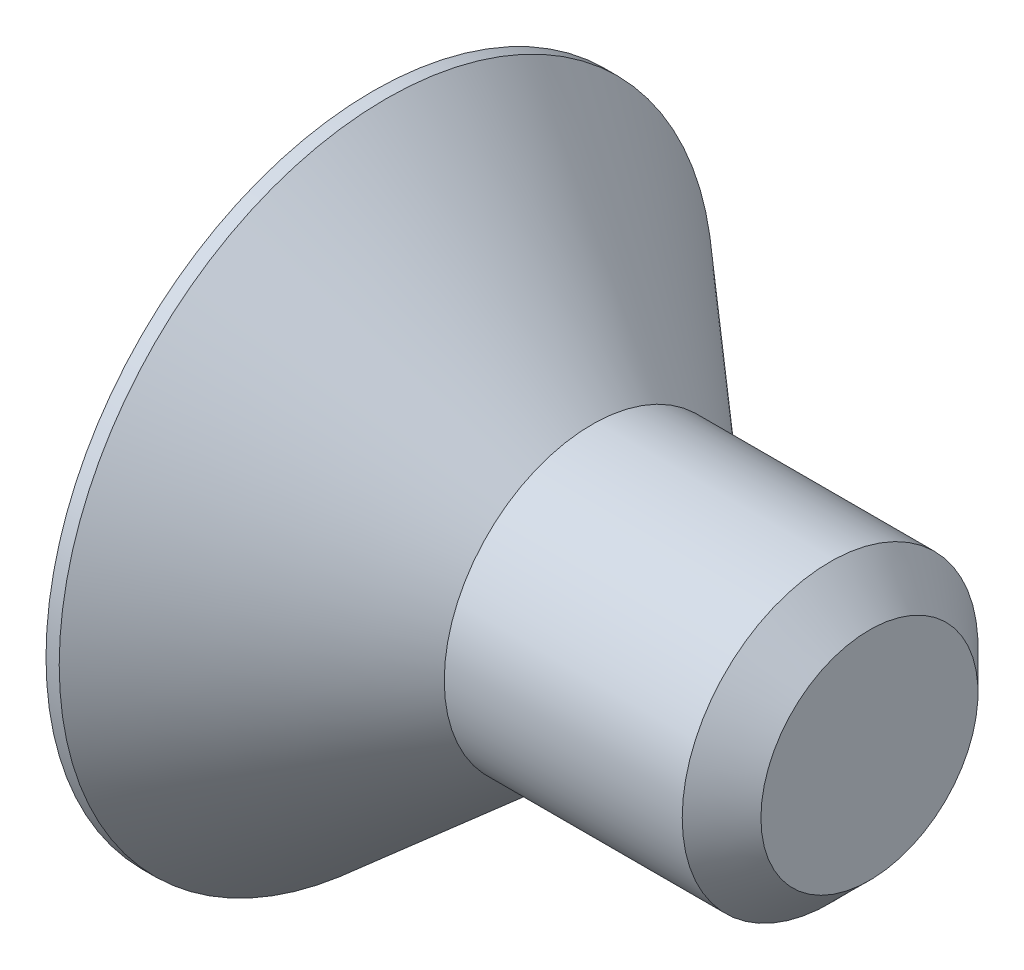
ISO-10303-21;
HEADER;
FILE_DESCRIPTION(('STEP AP214'),'2;1');
FILE_NAME('part.step','',(''),(''),'','','');
FILE_SCHEMA(('AUTOMOTIVE_DESIGN { 1 0 10303 214 1 1 1 1 }'));
ENDSEC;
DATA;
#1=APPLICATION_CONTEXT('core data for automotive mechanical design processes');
#2=APPLICATION_PROTOCOL_DEFINITION('international standard','automotive_design',2000,#1);
#3=PRODUCT_CONTEXT('',#1,'mechanical');
#4=PRODUCT('Part','Part','',(#3));
#5=PRODUCT_RELATED_PRODUCT_CATEGORY('part','',(#4));
#6=PRODUCT_DEFINITION_FORMATION('','',#4);
#7=PRODUCT_DEFINITION_CONTEXT('part definition',#1,'design');
#8=PRODUCT_DEFINITION('design','',#6,#7);
#9=PRODUCT_DEFINITION_SHAPE('','',#8);
#10=(LENGTH_UNIT() NAMED_UNIT(*) SI_UNIT(.MILLI.,.METRE.));
#11=(NAMED_UNIT(*) PLANE_ANGLE_UNIT() SI_UNIT($,.RADIAN.));
#12=(NAMED_UNIT(*) SI_UNIT($,.STERADIAN.) SOLID_ANGLE_UNIT());
#13=UNCERTAINTY_MEASURE_WITH_UNIT(LENGTH_MEASURE(1.E-05),#10,'distance_accuracy_value','');
#14=(GEOMETRIC_REPRESENTATION_CONTEXT(3) GLOBAL_UNCERTAINTY_ASSIGNED_CONTEXT((#13)) GLOBAL_UNIT_ASSIGNED_CONTEXT((#10,
#11,#12)) REPRESENTATION_CONTEXT('',''));
#15=CARTESIAN_POINT('',(0.,0.,0.));
#16=DIRECTION('',(0.,0.,1.));
#17=DIRECTION('',(1.,0.,0.));
#18=AXIS2_PLACEMENT_3D('',#15,#16,#17);
#19=CARTESIAN_POINT('',(0.,0.,0.));
#20=DIRECTION('',(-1.,0.,0.));
#21=DIRECTION('',(0.,0.,1.));
#22=AXIS2_PLACEMENT_3D('',#19,#20,#21);
#23=PLANE('',#22);
#24=CARTESIAN_POINT('',(0.,0.,0.));
#25=DIRECTION('',(-1.,0.,0.));
#26=DIRECTION('',(0.,0.,1.));
#27=AXIS2_PLACEMENT_3D('',#24,#25,#26);
#28=CIRCLE('',#27,3.14452);
#29=CARTESIAN_POINT('',(0.,0.,3.14452));
#30=VERTEX_POINT('',#29);
#31=EDGE_CURVE('E11',#30,#30,#28,.T.);
#32=ORIENTED_EDGE('',*,*,#31,.T.);
#33=EDGE_LOOP('',(#32));
#34=FACE_BOUND('',#33,.T.);
#35=DIRECTION('',(0.,-0.5,-0.866025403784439));
#36=VECTOR('',#35,1.);
#37=CARTESIAN_POINT('',(0.,-0.458271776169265,0.79375));
#38=LINE('',#37,#36);
#39=CARTESIAN_POINT('',(0.,-0.458271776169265,0.79375));
#40=VERTEX_POINT('',#39);
#41=CARTESIAN_POINT('',(0.,-0.916543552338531,0.));
#42=VERTEX_POINT('',#41);
#43=EDGE_CURVE('E116',#40,#42,#38,.T.);
#44=ORIENTED_EDGE('',*,*,#43,.T.);
#45=DIRECTION('',(0.,0.5,-0.866025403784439));
#46=VECTOR('',#45,1.);
#47=CARTESIAN_POINT('',(0.,-0.91654355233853,0.));
#48=LINE('',#47,#46);
#49=CARTESIAN_POINT('',(0.,-0.458271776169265,-0.79375));
#50=VERTEX_POINT('',#49);
#51=EDGE_CURVE('E47',#42,#50,#48,.T.);
#52=ORIENTED_EDGE('',*,*,#51,.T.);
#53=DIRECTION('',(0.,1.,0.));
#54=VECTOR('',#53,1.);
#55=CARTESIAN_POINT('',(0.,-0.458271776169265,-0.79375));
#56=LINE('',#55,#54);
#57=CARTESIAN_POINT('',(0.,0.458271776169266,-0.79375));
#58=VERTEX_POINT('',#57);
#59=EDGE_CURVE('E127',#50,#58,#56,.T.);
#60=ORIENTED_EDGE('',*,*,#59,.T.);
#61=DIRECTION('',(0.,0.5,0.866025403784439));
#62=VECTOR('',#61,1.);
#63=CARTESIAN_POINT('',(0.,0.458271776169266,-0.79375));
#64=LINE('',#63,#62);
#65=CARTESIAN_POINT('',(0.,0.916543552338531,0.));
#66=VERTEX_POINT('',#65);
#67=EDGE_CURVE('E198',#58,#66,#64,.T.);
#68=ORIENTED_EDGE('',*,*,#67,.T.);
#69=DIRECTION('',(0.,-0.5,0.866025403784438));
#70=VECTOR('',#69,1.);
#71=CARTESIAN_POINT('',(0.,0.916543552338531,0.));
#72=LINE('',#71,#70);
#73=CARTESIAN_POINT('',(0.,0.458271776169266,0.79375));
#74=VERTEX_POINT('',#73);
#75=EDGE_CURVE('E181',#66,#74,#72,.T.);
#76=ORIENTED_EDGE('',*,*,#75,.T.);
#77=DIRECTION('',(0.,-1.,0.));
#78=VECTOR('',#77,1.);
#79=CARTESIAN_POINT('',(0.,0.458271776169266,0.79375));
#80=LINE('',#79,#78);
#81=EDGE_CURVE('E176',#74,#40,#80,.T.);
#82=ORIENTED_EDGE('',*,*,#81,.T.);
#83=EDGE_LOOP('',(#44,#52,#60,#68,#76,#82));
#84=FACE_BOUND('',#83,.T.);
#85=ADVANCED_FACE('F33',(#34,#84),#23,.T.);
#86=CARTESIAN_POINT('',(0.,0.,0.));
#87=DIRECTION('',(-1.,0.,0.));
#88=DIRECTION('',(0.,0.,1.));
#89=AXIS2_PLACEMENT_3D('',#86,#87,#88);
#90=CYLINDRICAL_SURFACE('',#89,3.14452);
#91=CARTESIAN_POINT('',(0.127,0.,0.));
#92=DIRECTION('',(-1.,0.,0.));
#93=DIRECTION('',(0.,0.,1.));
#94=AXIS2_PLACEMENT_3D('',#91,#92,#93);
#95=CIRCLE('',#94,3.14452);
#96=CARTESIAN_POINT('',(0.127,0.,3.14452));
#97=VERTEX_POINT('',#96);
#98=EDGE_CURVE('E40',#97,#97,#95,.T.);
#99=ORIENTED_EDGE('',*,*,#98,.T.);
#100=EDGE_LOOP('',(#99));
#101=FACE_BOUND('',#100,.T.);
#102=ORIENTED_EDGE('',*,*,#31,.F.);
#103=EDGE_LOOP('',(#102));
#104=FACE_BOUND('',#103,.T.);
#105=ADVANCED_FACE('F152',(#101,#104),#90,.T.);
#106=CARTESIAN_POINT('',(0.127,0.,0.));
#107=DIRECTION('',(-1.,0.,0.));
#108=DIRECTION('',(0.,0.,1.));
#109=AXIS2_PLACEMENT_3D('',#106,#107,#108);
#110=CONICAL_SURFACE('',#109,3.14452,0.715584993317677);
#111=CARTESIAN_POINT('',(2.10807244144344,0.,0.));
#112=DIRECTION('',(-1.,0.,0.));
#113=DIRECTION('',(0.,0.,1.));
#114=AXIS2_PLACEMENT_3D('',#111,#112,#113);
#115=CIRCLE('',#114,1.4224);
#116=CARTESIAN_POINT('',(2.10807244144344,0.,1.4224));
#117=VERTEX_POINT('',#116);
#118=EDGE_CURVE('E147',#117,#117,#115,.T.);
#119=ORIENTED_EDGE('',*,*,#118,.T.);
#120=EDGE_LOOP('',(#119));
#121=FACE_BOUND('',#120,.T.);
#122=ORIENTED_EDGE('',*,*,#98,.F.);
#123=EDGE_LOOP('',(#122));
#124=FACE_BOUND('',#123,.T.);
#125=ADVANCED_FACE('F155',(#121,#124),#110,.T.);
#126=CARTESIAN_POINT('',(0.,0.,0.));
#127=DIRECTION('',(-1.,0.,0.));
#128=DIRECTION('',(0.,0.,1.));
#129=AXIS2_PLACEMENT_3D('',#126,#127,#128);
#130=CYLINDRICAL_SURFACE('',#129,1.42239999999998);
#131=CARTESIAN_POINT('',(4.39673999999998,0.,0.));
#132=DIRECTION('',(-1.,0.,0.));
#133=DIRECTION('',(0.,0.,1.));
#134=AXIS2_PLACEMENT_3D('',#131,#132,#133);
#135=CIRCLE('',#134,1.42239999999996);
#136=CARTESIAN_POINT('',(4.39673999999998,0.,1.42239999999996));
#137=VERTEX_POINT('',#136);
#138=EDGE_CURVE('E144',#137,#137,#135,.T.);
#139=ORIENTED_EDGE('',*,*,#138,.T.);
#140=EDGE_LOOP('',(#139));
#141=FACE_BOUND('',#140,.T.);
#142=ORIENTED_EDGE('',*,*,#118,.F.);
#143=EDGE_LOOP('',(#142));
#144=FACE_BOUND('',#143,.T.);
#145=ADVANCED_FACE('F157',(#141,#144),#130,.T.);
#146=CARTESIAN_POINT('',(4.7752,0.,0.));
#147=DIRECTION('',(-1.,0.,0.));
#148=DIRECTION('',(0.,0.,1.));
#149=AXIS2_PLACEMENT_3D('',#146,#147,#148);
#150=CONICAL_SURFACE('',#149,1.04394,0.785398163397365);
#151=ORIENTED_EDGE('',*,*,#138,.F.);
#152=EDGE_LOOP('',(#151));
#153=FACE_BOUND('',#152,.T.);
#154=CARTESIAN_POINT('',(4.7752,0.,0.));
#155=DIRECTION('',(-1.,0.,0.));
#156=DIRECTION('',(0.,0.,1.));
#157=AXIS2_PLACEMENT_3D('',#154,#155,#156);
#158=CIRCLE('',#157,1.04394);
#159=CARTESIAN_POINT('',(4.7752,0.,1.04394));
#160=VERTEX_POINT('',#159);
#161=EDGE_CURVE('E140',#160,#160,#158,.T.);
#162=ORIENTED_EDGE('',*,*,#161,.T.);
#163=EDGE_LOOP('',(#162));
#164=FACE_BOUND('',#163,.T.);
#165=ADVANCED_FACE('F164',(#153,#164),#150,.T.);
#166=CARTESIAN_POINT('',(4.7752,1.04394,0.));
#167=DIRECTION('',(1.,0.,0.));
#168=DIRECTION('',(0.,0.,-1.));
#169=AXIS2_PLACEMENT_3D('',#166,#167,#168);
#170=PLANE('',#169);
#171=ORIENTED_EDGE('',*,*,#161,.F.);
#172=EDGE_LOOP('',(#171));
#173=FACE_BOUND('',#172,.T.);
#174=ADVANCED_FACE('F264',(#173),#170,.T.);
#175=CARTESIAN_POINT('',(1.397,-0.91654355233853,0.));
#176=DIRECTION('',(0.,0.866025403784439,0.5));
#177=DIRECTION('',(0.,-0.5,0.866025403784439));
#178=AXIS2_PLACEMENT_3D('',#175,#176,#177);
#179=PLANE('',#178);
#180=ORIENTED_EDGE('',*,*,#51,.F.);
#181=DIRECTION('',(-1.,0.,0.));
#182=VECTOR('',#181,1.);
#183=CARTESIAN_POINT('',(1.397,-0.91654355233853,0.));
#184=LINE('',#183,#182);
#185=CARTESIAN_POINT('',(1.397,-0.91654355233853,0.));
#186=VERTEX_POINT('',#185);
#187=EDGE_CURVE('E185',#186,#42,#184,.T.);
#188=ORIENTED_EDGE('',*,*,#187,.F.);
#189=DIRECTION('',(0.,0.5,-0.866025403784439));
#190=VECTOR('',#189,1.);
#191=CARTESIAN_POINT('',(1.397,-0.91654355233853,0.));
#192=LINE('',#191,#190);
#193=CARTESIAN_POINT('',(1.397,-0.687407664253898,-0.396875));
#194=VERTEX_POINT('',#193);
#195=EDGE_CURVE('E112',#186,#194,#192,.T.);
#196=ORIENTED_EDGE('',*,*,#195,.T.);
#197=CARTESIAN_POINT('',(1.397,-0.458271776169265,-0.79375));
#198=VERTEX_POINT('',#197);
#199=EDGE_CURVE('E108',#194,#198,#192,.T.);
#200=ORIENTED_EDGE('',*,*,#199,.T.);
#201=DIRECTION('',(-1.,0.,0.));
#202=VECTOR('',#201,1.);
#203=CARTESIAN_POINT('',(1.397,-0.458271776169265,-0.79375));
#204=LINE('',#203,#202);
#205=EDGE_CURVE('E110',#198,#50,#204,.T.);
#206=ORIENTED_EDGE('',*,*,#205,.T.);
#207=EDGE_LOOP('',(#180,#188,#196,#200,#206));
#208=FACE_BOUND('',#207,.T.);
#209=ADVANCED_FACE('F109',(#208),#179,.T.);
#210=CARTESIAN_POINT('',(1.397,-0.458271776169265,-0.79375));
#211=DIRECTION('',(0.,0.,1.));
#212=DIRECTION('',(1.,0.,0.));
#213=AXIS2_PLACEMENT_3D('',#210,#211,#212);
#214=PLANE('',#213);
#215=ORIENTED_EDGE('',*,*,#59,.F.);
#216=ORIENTED_EDGE('',*,*,#205,.F.);
#217=DIRECTION('',(0.,1.,0.));
#218=VECTOR('',#217,1.);
#219=CARTESIAN_POINT('',(1.397,-0.458271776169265,-0.79375));
#220=LINE('',#219,#218);
#221=CARTESIAN_POINT('',(1.397,0.,-0.79375));
#222=VERTEX_POINT('',#221);
#223=EDGE_CURVE('E55',#198,#222,#220,.T.);
#224=ORIENTED_EDGE('',*,*,#223,.T.);
#225=CARTESIAN_POINT('',(1.397,0.458271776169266,-0.79375));
#226=VERTEX_POINT('',#225);
#227=EDGE_CURVE('E122',#222,#226,#220,.T.);
#228=ORIENTED_EDGE('',*,*,#227,.T.);
#229=DIRECTION('',(-1.,0.,0.));
#230=VECTOR('',#229,1.);
#231=CARTESIAN_POINT('',(1.397,0.458271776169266,-0.79375));
#232=LINE('',#231,#230);
#233=EDGE_CURVE('E129',#226,#58,#232,.T.);
#234=ORIENTED_EDGE('',*,*,#233,.T.);
#235=EDGE_LOOP('',(#215,#216,#224,#228,#234));
#236=FACE_BOUND('',#235,.T.);
#237=ADVANCED_FACE('F124',(#236),#214,.T.);
#238=CARTESIAN_POINT('',(1.397,0.458271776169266,-0.79375));
#239=DIRECTION('',(0.,-0.866025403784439,0.5));
#240=DIRECTION('',(0.,-0.5,-0.866025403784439));
#241=AXIS2_PLACEMENT_3D('',#238,#239,#240);
#242=PLANE('',#241);
#243=ORIENTED_EDGE('',*,*,#67,.F.);
#244=ORIENTED_EDGE('',*,*,#233,.F.);
#245=DIRECTION('',(0.,0.5,0.866025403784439));
#246=VECTOR('',#245,1.);
#247=CARTESIAN_POINT('',(1.397,0.458271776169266,-0.79375));
#248=LINE('',#247,#246);
#249=CARTESIAN_POINT('',(1.397,0.687407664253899,-0.396875));
#250=VERTEX_POINT('',#249);
#251=EDGE_CURVE('E218',#226,#250,#248,.T.);
#252=ORIENTED_EDGE('',*,*,#251,.T.);
#253=CARTESIAN_POINT('',(1.397,0.916543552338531,0.));
#254=VERTEX_POINT('',#253);
#255=EDGE_CURVE('E121',#250,#254,#248,.T.);
#256=ORIENTED_EDGE('',*,*,#255,.T.);
#257=DIRECTION('',(-1.,0.,0.));
#258=VECTOR('',#257,1.);
#259=CARTESIAN_POINT('',(1.397,0.916543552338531,0.));
#260=LINE('',#259,#258);
#261=EDGE_CURVE('E135',#254,#66,#260,.T.);
#262=ORIENTED_EDGE('',*,*,#261,.T.);
#263=EDGE_LOOP('',(#243,#244,#252,#256,#262));
#264=FACE_BOUND('',#263,.T.);
#265=ADVANCED_FACE('F196',(#264),#242,.T.);
#266=CARTESIAN_POINT('',(1.397,0.916543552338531,0.));
#267=DIRECTION('',(0.,-0.866025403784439,-0.5));
#268=DIRECTION('',(0.,0.5,-0.866025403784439));
#269=AXIS2_PLACEMENT_3D('',#266,#267,#268);
#270=PLANE('',#269);
#271=ORIENTED_EDGE('',*,*,#75,.F.);
#272=ORIENTED_EDGE('',*,*,#261,.F.);
#273=DIRECTION('',(0.,-0.5,0.866025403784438));
#274=VECTOR('',#273,1.);
#275=CARTESIAN_POINT('',(1.397,0.916543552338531,0.));
#276=LINE('',#275,#274);
#277=CARTESIAN_POINT('',(1.397,0.687407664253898,0.396875));
#278=VERTEX_POINT('',#277);
#279=EDGE_CURVE('E215',#254,#278,#276,.T.);
#280=ORIENTED_EDGE('',*,*,#279,.T.);
#281=CARTESIAN_POINT('',(1.397,0.458271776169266,0.79375));
#282=VERTEX_POINT('',#281);
#283=EDGE_CURVE('E217',#278,#282,#276,.T.);
#284=ORIENTED_EDGE('',*,*,#283,.T.);
#285=DIRECTION('',(-1.,0.,0.));
#286=VECTOR('',#285,1.);
#287=CARTESIAN_POINT('',(1.397,0.458271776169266,0.79375));
#288=LINE('',#287,#286);
#289=EDGE_CURVE('E190',#282,#74,#288,.T.);
#290=ORIENTED_EDGE('',*,*,#289,.T.);
#291=EDGE_LOOP('',(#271,#272,#280,#284,#290));
#292=FACE_BOUND('',#291,.T.);
#293=ADVANCED_FACE('F228',(#292),#270,.T.);
#294=CARTESIAN_POINT('',(1.397,0.458271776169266,0.79375));
#295=DIRECTION('',(0.,0.,-1.));
#296=DIRECTION('',(-1.,0.,0.));
#297=AXIS2_PLACEMENT_3D('',#294,#295,#296);
#298=PLANE('',#297);
#299=ORIENTED_EDGE('',*,*,#81,.F.);
#300=ORIENTED_EDGE('',*,*,#289,.F.);
#301=DIRECTION('',(0.,-1.,0.));
#302=VECTOR('',#301,1.);
#303=CARTESIAN_POINT('',(1.397,0.458271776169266,0.79375));
#304=LINE('',#303,#302);
#305=CARTESIAN_POINT('',(1.397,0.,0.79375));
#306=VERTEX_POINT('',#305);
#307=EDGE_CURVE('E211',#282,#306,#304,.T.);
#308=ORIENTED_EDGE('',*,*,#307,.T.);
#309=CARTESIAN_POINT('',(1.397,-0.458271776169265,0.79375));
#310=VERTEX_POINT('',#309);
#311=EDGE_CURVE('E214',#306,#310,#304,.T.);
#312=ORIENTED_EDGE('',*,*,#311,.T.);
#313=DIRECTION('',(-1.,0.,0.));
#314=VECTOR('',#313,1.);
#315=CARTESIAN_POINT('',(1.397,-0.458271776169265,0.79375));
#316=LINE('',#315,#314);
#317=EDGE_CURVE('E187',#310,#40,#316,.T.);
#318=ORIENTED_EDGE('',*,*,#317,.T.);
#319=EDGE_LOOP('',(#299,#300,#308,#312,#318));
#320=FACE_BOUND('',#319,.T.);
#321=ADVANCED_FACE('F241',(#320),#298,.T.);
#322=CARTESIAN_POINT('',(1.397,-0.458271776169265,0.79375));
#323=DIRECTION('',(0.,0.866025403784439,-0.5));
#324=DIRECTION('',(0.,0.5,0.866025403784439));
#325=AXIS2_PLACEMENT_3D('',#322,#323,#324);
#326=PLANE('',#325);
#327=ORIENTED_EDGE('',*,*,#43,.F.);
#328=ORIENTED_EDGE('',*,*,#317,.F.);
#329=DIRECTION('',(0.,-0.5,-0.866025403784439));
#330=VECTOR('',#329,1.);
#331=CARTESIAN_POINT('',(1.397,-0.458271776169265,0.79375));
#332=LINE('',#331,#330);
#333=CARTESIAN_POINT('',(1.397,-0.687407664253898,0.396875));
#334=VERTEX_POINT('',#333);
#335=EDGE_CURVE('E188',#310,#334,#332,.T.);
#336=ORIENTED_EDGE('',*,*,#335,.T.);
#337=EDGE_CURVE('E210',#334,#186,#332,.T.);
#338=ORIENTED_EDGE('',*,*,#337,.T.);
#339=ORIENTED_EDGE('',*,*,#187,.T.);
#340=EDGE_LOOP('',(#327,#328,#336,#338,#339));
#341=FACE_BOUND('',#340,.T.);
#342=ADVANCED_FACE('F242',(#341),#326,.T.);
#343=CARTESIAN_POINT('',(1.397,-0.458271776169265,-0.79375));
#344=DIRECTION('',(1.,0.,0.));
#345=DIRECTION('',(0.,0.,-1.));
#346=AXIS2_PLACEMENT_3D('',#343,#344,#345);
#347=PLANE('',#346);
#348=ORIENTED_EDGE('',*,*,#223,.F.);
#349=ORIENTED_EDGE('',*,*,#199,.F.);
#350=CARTESIAN_POINT('',(1.397,0.,0.));
#351=DIRECTION('',(-1.,0.,0.));
#352=DIRECTION('',(0.,0.,1.));
#353=AXIS2_PLACEMENT_3D('',#350,#351,#352);
#354=CIRCLE('',#353,0.79375);
#355=EDGE_CURVE('E119',#222,#194,#354,.T.);
#356=ORIENTED_EDGE('',*,*,#355,.F.);
#357=EDGE_LOOP('',(#348,#349,#356));
#358=FACE_BOUND('',#357,.T.);
#359=ADVANCED_FACE('F118',(#358),#347,.F.);
#360=ORIENTED_EDGE('',*,*,#195,.F.);
#361=ORIENTED_EDGE('',*,*,#337,.F.);
#362=EDGE_CURVE('E132',#194,#334,#354,.T.);
#363=ORIENTED_EDGE('',*,*,#362,.F.);
#364=EDGE_LOOP('',(#360,#361,#363));
#365=FACE_BOUND('',#364,.T.);
#366=ADVANCED_FACE('F244',(#365),#347,.F.);
#367=ORIENTED_EDGE('',*,*,#335,.F.);
#368=ORIENTED_EDGE('',*,*,#311,.F.);
#369=EDGE_CURVE('E128',#334,#306,#354,.T.);
#370=ORIENTED_EDGE('',*,*,#369,.F.);
#371=EDGE_LOOP('',(#367,#368,#370));
#372=FACE_BOUND('',#371,.T.);
#373=ADVANCED_FACE('F238',(#372),#347,.F.);
#374=ORIENTED_EDGE('',*,*,#307,.F.);
#375=ORIENTED_EDGE('',*,*,#283,.F.);
#376=EDGE_CURVE('E134',#306,#278,#354,.T.);
#377=ORIENTED_EDGE('',*,*,#376,.F.);
#378=EDGE_LOOP('',(#374,#375,#377));
#379=FACE_BOUND('',#378,.T.);
#380=ADVANCED_FACE('F235',(#379),#347,.F.);
#381=ORIENTED_EDGE('',*,*,#279,.F.);
#382=ORIENTED_EDGE('',*,*,#255,.F.);
#383=EDGE_CURVE('E141',#278,#250,#354,.T.);
#384=ORIENTED_EDGE('',*,*,#383,.F.);
#385=EDGE_LOOP('',(#381,#382,#384));
#386=FACE_BOUND('',#385,.T.);
#387=ADVANCED_FACE('F226',(#386),#347,.F.);
#388=ORIENTED_EDGE('',*,*,#251,.F.);
#389=ORIENTED_EDGE('',*,*,#227,.F.);
#390=EDGE_CURVE('E223',#250,#222,#354,.T.);
#391=ORIENTED_EDGE('',*,*,#390,.F.);
#392=EDGE_LOOP('',(#388,#389,#391));
#393=FACE_BOUND('',#392,.T.);
#394=ADVANCED_FACE('F222',(#393),#347,.F.);
#395=CARTESIAN_POINT('',(1.397,0.,0.));
#396=DIRECTION('',(-1.,0.,0.));
#397=DIRECTION('',(0.,0.,1.));
#398=AXIS2_PLACEMENT_3D('',#395,#396,#397);
#399=CONICAL_SURFACE('',#398,0.79375,1.04719755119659);
#400=CARTESIAN_POINT('',(1.85527177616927,0.,0.));
#401=VERTEX_POINT('',#400);
#402=VERTEX_LOOP('',#401);
#403=FACE_BOUND('',#402,.T.);
#404=ORIENTED_EDGE('',*,*,#376,.T.);
#405=ORIENTED_EDGE('',*,*,#383,.T.);
#406=ORIENTED_EDGE('',*,*,#390,.T.);
#407=ORIENTED_EDGE('',*,*,#355,.T.);
#408=ORIENTED_EDGE('',*,*,#362,.T.);
#409=ORIENTED_EDGE('',*,*,#369,.T.);
#410=EDGE_LOOP('',(#404,#405,#406,#407,#408,#409));
#411=FACE_BOUND('',#410,.T.);
#412=ADVANCED_FACE('F230',(#403,#411),#399,.F.);
#413=CLOSED_SHELL('',(#85,#105,#125,#145,#165,#174,#209,#237,#265,#293,#321,#342,#359,#366,#373,
#380,#387,#394,#412));
#414=MANIFOLD_SOLID_BREP('B2',#413);
#415=ADVANCED_BREP_SHAPE_REPRESENTATION('',(#18,#414),#14);
#416=SHAPE_DEFINITION_REPRESENTATION(#9,#415);
ENDSEC;
END-ISO-10303-21;
